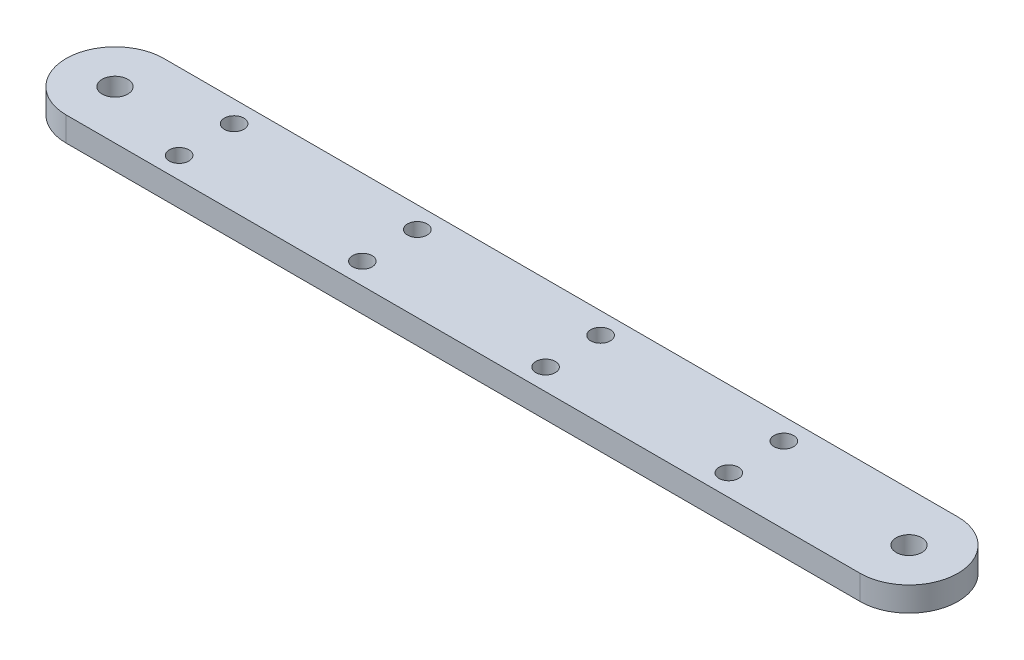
from build123d import *

# Parameters (mm, degrees)
SKETCH_1_R          = 2.1
EXTRUDE_1_DEPTH     = 4
SKETCH_2_R          = 1.6
CUT_EXTRUDE_1_DEPTH = 74.545904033


with BuildPart() as part:
    # Sketch 1 → Extrude 1 (new body)
    with BuildSketch(Plane(origin=(0, 0, 0), x_dir=(1, 0, 0), z_dir=(0, 1, 0))):
        with BuildLine():
            Line((-65, 8), (65, 8))
            ThreePointArc((65, 8), (73, 0), (65, -8))
            Line((65, -8), (-65, -8))
            ThreePointArc((-65, -8), (-73, 0), (-65, 8))
        make_face()
        with Locations(Location((-65, 0, 0), (0, 0, 270))):
            Circle(SKETCH_1_R, mode=Mode.SUBTRACT)
        with Locations(Location((65, 0, 0), (0, 0, 270))):
            Circle(SKETCH_1_R, mode=Mode.SUBTRACT)
    extrude(amount=EXTRUDE_1_DEPTH)

    # Sketch 2 → Cut-Extrude 1 (cut, through all)
    with BuildSketch(Plane(origin=(0, 4, 0), x_dir=(1, 0, 0), z_dir=(0, 1, 0))):
        with Locations(Location((-50, 4.5, 0), (0, 0, 270))):
            Circle(SKETCH_2_R)
        with Locations(Location((-20, 4.5, 0), (0, 0, 270))):
            Circle(SKETCH_2_R)
        with Locations(Location((10, 4.5, 0), (0, 0, 270))):
            Circle(SKETCH_2_R)
        with Locations(Location((40, 4.5, 0), (0, 0, 270))):
            Circle(SKETCH_2_R)
        with Locations(Location((-20, -4.5, 0), (0, 0, 270))):
            Circle(SKETCH_2_R)
        with Locations(Location((10, -4.5, 0), (0, 0, 270))):
            Circle(SKETCH_2_R)
        with Locations(Location((40, -4.5, 0), (0, 0, 270))):
            Circle(SKETCH_2_R)
        with Locations(Location((-50, -4.5, 0), (0, 0, 270))):
            Circle(SKETCH_2_R)
    extrude(amount=-CUT_EXTRUDE_1_DEPTH, mode=Mode.SUBTRACT)


solid = part.part
